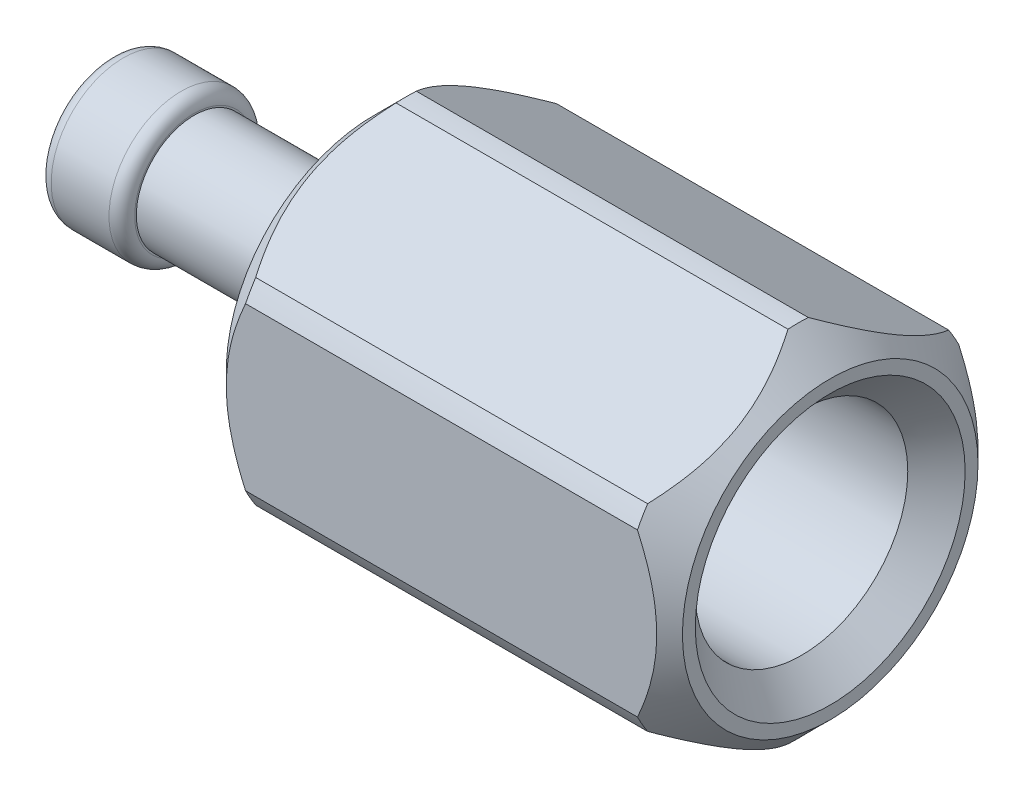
ISO-10303-21;
HEADER;
FILE_DESCRIPTION(('STEP AP214'),'2;1');
FILE_NAME('part.step','',(''),(''),'','','');
FILE_SCHEMA(('AUTOMOTIVE_DESIGN { 1 0 10303 214 1 1 1 1 }'));
ENDSEC;
DATA;
#1=APPLICATION_CONTEXT('core data for automotive mechanical design processes');
#2=APPLICATION_PROTOCOL_DEFINITION('international standard','automotive_design',2000,#1);
#3=PRODUCT_CONTEXT('',#1,'mechanical');
#4=PRODUCT('Part','Part','',(#3));
#5=PRODUCT_RELATED_PRODUCT_CATEGORY('part','',(#4));
#6=PRODUCT_DEFINITION_FORMATION('','',#4);
#7=PRODUCT_DEFINITION_CONTEXT('part definition',#1,'design');
#8=PRODUCT_DEFINITION('design','',#6,#7);
#9=PRODUCT_DEFINITION_SHAPE('','',#8);
#10=(LENGTH_UNIT() NAMED_UNIT(*) SI_UNIT(.MILLI.,.METRE.));
#11=(NAMED_UNIT(*) PLANE_ANGLE_UNIT() SI_UNIT($,.RADIAN.));
#12=(NAMED_UNIT(*) SI_UNIT($,.STERADIAN.) SOLID_ANGLE_UNIT());
#13=UNCERTAINTY_MEASURE_WITH_UNIT(LENGTH_MEASURE(1.E-05),#10,'distance_accuracy_value','');
#14=(GEOMETRIC_REPRESENTATION_CONTEXT(3) GLOBAL_UNCERTAINTY_ASSIGNED_CONTEXT((#13)) GLOBAL_UNIT_ASSIGNED_CONTEXT((#10,
#11,#12)) REPRESENTATION_CONTEXT('',''));
#15=CARTESIAN_POINT('',(0.,0.,0.));
#16=DIRECTION('',(0.,0.,1.));
#17=DIRECTION('',(1.,0.,0.));
#18=AXIS2_PLACEMENT_3D('',#15,#16,#17);
#19=CARTESIAN_POINT('',(-8.382,0.,0.));
#20=DIRECTION('',(1.,0.,0.));
#21=DIRECTION('',(0.,0.,-1.));
#22=AXIS2_PLACEMENT_3D('',#19,#20,#21);
#23=CONICAL_SURFACE('',#22,3.556,0.785398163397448);
#24=CARTESIAN_POINT('',(-9.017,0.,0.));
#25=DIRECTION('',(1.,0.,0.));
#26=DIRECTION('',(0.,0.,-1.));
#27=AXIS2_PLACEMENT_3D('',#24,#25,#26);
#28=CIRCLE('',#27,2.921);
#29=CARTESIAN_POINT('',(-9.017,0.,-2.921));
#30=VERTEX_POINT('',#29);
#31=EDGE_CURVE('E191',#30,#30,#28,.T.);
#32=ORIENTED_EDGE('',*,*,#31,.T.);
#33=EDGE_LOOP('',(#32));
#34=FACE_BOUND('',#33,.T.);
#35=CARTESIAN_POINT('',(-8.382,0.,0.));
#36=DIRECTION('',(1.,0.,0.));
#37=DIRECTION('',(0.,0.,-1.));
#38=AXIS2_PLACEMENT_3D('',#35,#36,#37);
#39=CIRCLE('',#38,3.556);
#40=CARTESIAN_POINT('',(-8.382,3.55033519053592,-0.200639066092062));
#41=VERTEX_POINT('',#40);
#42=CARTESIAN_POINT('',(-8.382,3.55033519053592,0.200639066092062));
#43=VERTEX_POINT('',#42);
#44=EDGE_CURVE('E163',#41,#43,#39,.T.);
#45=ORIENTED_EDGE('',*,*,#44,.F.);
#46=CARTESIAN_POINT('',(-8.3818,3.55055722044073,-0.200254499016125));
#47=CARTESIAN_POINT('',(-8.43296161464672,3.49375134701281,-0.298645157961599));
#48=CARTESIAN_POINT('',(-8.48060823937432,3.43606310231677,-0.398564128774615));
#49=CARTESIAN_POINT('',(-8.56688969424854,3.31877983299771,-0.601704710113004));
#50=CARTESIAN_POINT('',(-8.60548813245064,3.2591781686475,-0.704937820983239));
#51=CARTESIAN_POINT('',(-8.67084942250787,3.13911696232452,-0.91288993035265));
#52=CARTESIAN_POINT('',(-8.69775151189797,3.07867688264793,-1.01757521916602));
#53=CARTESIAN_POINT('',(-8.73833497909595,2.95677146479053,-1.22872159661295));
#54=CARTESIAN_POINT('',(-8.75203787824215,2.89530796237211,-1.33517950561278));
#55=CARTESIAN_POINT('',(-8.76460046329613,2.77647875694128,-1.54099772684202));
#56=CARTESIAN_POINT('',(-8.76446635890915,2.71913982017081,-1.64031167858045));
#57=CARTESIAN_POINT('',(-8.75185752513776,2.60477875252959,-1.83839085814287));
#58=CARTESIAN_POINT('',(-8.73937638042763,2.54775680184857,-1.93715577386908));
#59=CARTESIAN_POINT('',(-8.70303697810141,2.43465417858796,-2.13305526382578));
#60=CARTESIAN_POINT('',(-8.67917993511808,2.37857340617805,-2.23019001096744));
#61=CARTESIAN_POINT('',(-8.62164221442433,2.26768383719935,-2.42225637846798));
#62=CARTESIAN_POINT('',(-8.58795788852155,2.21287552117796,-2.51718716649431));
#63=CARTESIAN_POINT('',(-8.52532732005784,2.12309386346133,-2.67269355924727));
#64=CARTESIAN_POINT('',(-8.49866428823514,2.08771271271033,-2.73397550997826));
#65=CARTESIAN_POINT('',(-8.44236199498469,2.01769059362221,-2.85525737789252));
#66=CARTESIAN_POINT('',(-8.41273355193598,1.9830474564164,-2.91526105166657));
#67=CARTESIAN_POINT('',(-8.38180000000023,1.94870409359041,-2.97474550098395));
#68=B_SPLINE_CURVE_WITH_KNOTS('',3,(#46,#47,#48,#49,#50,#51,#52,#53,#54,#55,#56,#57,#58,#59,#60,
#61,#62,#63,#64,#65,#66,#67),.UNSPECIFIED.,.F.,.F.,(4,2,2,2,2,2,2,2,2,2,4),(0.,0.37399067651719,
0.749460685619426,1.12032967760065,1.4905929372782,1.83395154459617,2.17748864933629,
2.52098908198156,2.86461719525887,3.09140700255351,3.31739767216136),.UNSPECIFIED.);
#69=CARTESIAN_POINT('',(-8.382,1.94892612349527,-2.97436093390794));
#70=VERTEX_POINT('',#69);
#71=EDGE_CURVE('E382',#41,#70,#68,.T.);
#72=ORIENTED_EDGE('',*,*,#71,.T.);
#73=CARTESIAN_POINT('',(-8.382,1.60140906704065,-3.175));
#74=VERTEX_POINT('',#73);
#75=EDGE_CURVE('E187',#74,#70,#39,.T.);
#76=ORIENTED_EDGE('',*,*,#75,.F.);
#77=CARTESIAN_POINT('',(-7.07760151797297,-3.68006092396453,-3.175));
#78=CARTESIAN_POINT('',(-7.14534932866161,-3.59056345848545,-3.175));
#79=CARTESIAN_POINT('',(-7.21244941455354,-3.50056760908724,-3.175));
#80=CARTESIAN_POINT('',(-7.34506326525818,-3.31938150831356,-3.175));
#81=CARTESIAN_POINT('',(-7.41057663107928,-3.22819096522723,-3.175));
#82=CARTESIAN_POINT('',(-7.54019214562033,-3.04375072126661,-3.175));
#83=CARTESIAN_POINT('',(-7.60427943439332,-2.95049054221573,-3.175));
#84=CARTESIAN_POINT('',(-7.73008604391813,-2.76239141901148,-3.175));
#85=CARTESIAN_POINT('',(-7.79180553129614,-2.66755258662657,-3.175));
#86=CARTESIAN_POINT('',(-7.91584629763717,-2.47048506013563,-3.175));
#87=CARTESIAN_POINT('',(-7.97799459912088,-2.36814693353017,-3.175));
#88=CARTESIAN_POINT('',(-8.0982367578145,-2.16107936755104,-3.175));
#89=CARTESIAN_POINT('',(-8.15632996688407,-2.05634954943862,-3.175));
#90=CARTESIAN_POINT('',(-8.26721077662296,-1.84450279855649,-3.175));
#91=CARTESIAN_POINT('',(-8.32001397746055,-1.73739409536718,-3.175));
#92=CARTESIAN_POINT('',(-8.41913251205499,-1.52023971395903,-3.175));
#93=CARTESIAN_POINT('',(-8.4654508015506,-1.41019540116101,-3.175));
#94=CARTESIAN_POINT('',(-8.54643032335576,-1.19627791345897,-3.175));
#95=CARTESIAN_POINT('',(-8.58174080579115,-1.09265308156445,-3.175));
#96=CARTESIAN_POINT('',(-8.64405164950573,-0.882887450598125,-3.175));
#97=CARTESIAN_POINT('',(-8.6710514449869,-0.776746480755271,-3.175));
#98=CARTESIAN_POINT('',(-8.71487451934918,-0.564359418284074,-3.175));
#99=CARTESIAN_POINT('',(-8.7318736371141,-0.458150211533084,-3.175));
#100=CARTESIAN_POINT('',(-8.75536158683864,-0.244569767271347,-3.175));
#101=CARTESIAN_POINT('',(-8.76185227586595,-0.13719873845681,-3.175));
#102=CARTESIAN_POINT('',(-8.76383093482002,0.0736456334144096,-3.175));
#103=CARTESIAN_POINT('',(-8.75971932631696,0.177115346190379,-3.175));
#104=CARTESIAN_POINT('',(-8.74160961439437,0.383180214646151,-3.175));
#105=CARTESIAN_POINT('',(-8.72761055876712,0.485775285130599,-3.175));
#106=CARTESIAN_POINT('',(-8.69025559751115,0.691083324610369,-3.175));
#107=CARTESIAN_POINT('',(-8.66673961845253,0.793766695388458,-3.175));
#108=CARTESIAN_POINT('',(-8.61161215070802,0.996893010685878,-3.175));
#109=CARTESIAN_POINT('',(-8.58000130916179,1.09733613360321,-3.175));
#110=CARTESIAN_POINT('',(-8.50693122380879,1.30453917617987,-3.175));
#111=CARTESIAN_POINT('',(-8.46485028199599,1.41107758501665,-3.175));
#112=CARTESIAN_POINT('',(-8.37422677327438,1.62137761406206,-3.175));
#113=CARTESIAN_POINT('',(-8.32568205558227,1.72513829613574,-3.175));
#114=CARTESIAN_POINT('',(-8.22327748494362,1.9304084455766,-3.175));
#115=CARTESIAN_POINT('',(-8.16940066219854,2.03190937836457,-3.175));
#116=CARTESIAN_POINT('',(-8.05752456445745,2.23257709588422,-3.175));
#117=CARTESIAN_POINT('',(-7.99952594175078,2.33174424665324,-3.175));
#118=CARTESIAN_POINT('',(-7.88318080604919,2.52317617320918,-3.175));
#119=CARTESIAN_POINT('',(-7.8249948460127,2.6155390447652,-3.175));
#120=CARTESIAN_POINT('',(-7.70617105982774,2.79867890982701,-3.175));
#121=CARTESIAN_POINT('',(-7.64553304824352,2.88945578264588,-3.175));
#122=CARTESIAN_POINT('',(-7.52274299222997,3.06889606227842,-3.175));
#123=CARTESIAN_POINT('',(-7.46060721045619,3.15757063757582,-3.175));
#124=CARTESIAN_POINT('',(-7.33468867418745,3.33370714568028,-3.175));
#125=CARTESIAN_POINT('',(-7.27090637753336,3.42116940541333,-3.175));
#126=CARTESIAN_POINT('',(-7.2064507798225,3.50812386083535,-3.175));
#127=B_SPLINE_CURVE_WITH_KNOTS('',3,(#77,#78,#79,#80,#81,#82,#83,#84,#85,#86,#87,#88,#89,#90,
#91,#92,#93,#94,#95,#96,#97,#98,#99,#100,#101,#102,#103,#104,#105,#106,#107,#108,#109,#110,#111,
#112,#113,#114,#115,#116,#117,#118,#119,#120,#121,#122,#123,#124,#125,#126),.UNSPECIFIED.,.F.,
.F.,(4,2,2,2,2,2,2,2,2,2,2,2,2,2,2,2,2,2,2,2,2,2,2,2,4),(0.,0.336749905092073,0.673583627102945,
1.01302616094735,1.35244476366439,1.71156294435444,2.07073839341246,2.42882136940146,
2.78674060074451,3.11488011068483,3.44304195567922,3.7652466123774,4.08739432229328,
4.39755499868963,4.70774554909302,5.02338597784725,5.33900118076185,5.68237822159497,
6.02586980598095,6.37049205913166,6.71505989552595,7.0425026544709,7.36997022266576,
7.69478261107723,8.01950563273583),.UNSPECIFIED.);
#128=CARTESIAN_POINT('',(-8.382,-1.60140906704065,-3.175));
#129=VERTEX_POINT('',#128);
#130=EDGE_CURVE('E291',#74,#129,#127,.F.);
#131=ORIENTED_EDGE('',*,*,#130,.T.);
#132=CARTESIAN_POINT('',(-8.382,-1.94892612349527,-2.97436093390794));
#133=VERTEX_POINT('',#132);
#134=EDGE_CURVE('E179',#133,#129,#39,.T.);
#135=ORIENTED_EDGE('',*,*,#134,.F.);
#136=CARTESIAN_POINT('',(-8.3818,-1.94870409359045,-2.97474550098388));
#137=CARTESIAN_POINT('',(-8.43296161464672,-2.00550996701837,-2.8763548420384));
#138=CARTESIAN_POINT('',(-8.48060823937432,-2.06319821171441,-2.77643587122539));
#139=CARTESIAN_POINT('',(-8.56688969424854,-2.18048148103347,-2.573295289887));
#140=CARTESIAN_POINT('',(-8.60548813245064,-2.24008314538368,-2.47006217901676));
#141=CARTESIAN_POINT('',(-8.67084942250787,-2.36014435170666,-2.26211006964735));
#142=CARTESIAN_POINT('',(-8.69775151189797,-2.42058443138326,-2.15742478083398));
#143=CARTESIAN_POINT('',(-8.73833497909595,-2.54248984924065,-1.94627840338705));
#144=CARTESIAN_POINT('',(-8.75203787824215,-2.60395335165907,-1.83982049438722));
#145=CARTESIAN_POINT('',(-8.76460046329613,-2.7227825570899,-1.63400227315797));
#146=CARTESIAN_POINT('',(-8.76446635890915,-2.78012149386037,-1.53468832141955));
#147=CARTESIAN_POINT('',(-8.75185752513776,-2.89448256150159,-1.33660914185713));
#148=CARTESIAN_POINT('',(-8.73937638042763,-2.95150451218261,-1.23784422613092));
#149=CARTESIAN_POINT('',(-8.70303697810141,-3.06460713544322,-1.04194473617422));
#150=CARTESIAN_POINT('',(-8.67917993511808,-3.12068790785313,-0.944809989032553));
#151=CARTESIAN_POINT('',(-8.62164221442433,-3.23157747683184,-0.752743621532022));
#152=CARTESIAN_POINT('',(-8.58795788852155,-3.28638579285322,-0.657812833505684));
#153=CARTESIAN_POINT('',(-8.52532732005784,-3.37616745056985,-0.502306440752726));
#154=CARTESIAN_POINT('',(-8.49866428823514,-3.41154860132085,-0.441024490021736));
#155=CARTESIAN_POINT('',(-8.44236199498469,-3.48157072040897,-0.319742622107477));
#156=CARTESIAN_POINT('',(-8.41273355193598,-3.51621385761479,-0.259738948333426));
#157=CARTESIAN_POINT('',(-8.38180000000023,-3.55055722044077,-0.200254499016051));
#158=B_SPLINE_CURVE_WITH_KNOTS('',3,(#136,#137,#138,#139,#140,#141,#142,#143,#144,#145,#146,
#147,#148,#149,#150,#151,#152,#153,#154,#155,#156,#157),.UNSPECIFIED.,.F.,.F.,(4,2,2,2,2,2,2,2,
2,2,4),(0.,0.373990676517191,0.749460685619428,1.12032967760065,1.4905929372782,
1.83395154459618,2.17748864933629,2.52098908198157,2.86461719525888,3.09140700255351,
3.31739767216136),.UNSPECIFIED.);
#159=CARTESIAN_POINT('',(-8.382,-3.55033519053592,-0.200639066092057));
#160=VERTEX_POINT('',#159);
#161=EDGE_CURVE('E282',#133,#160,#158,.T.);
#162=ORIENTED_EDGE('',*,*,#161,.T.);
#163=CARTESIAN_POINT('',(-8.382,-3.55033519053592,0.200639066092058));
#164=VERTEX_POINT('',#163);
#165=EDGE_CURVE('E466',#164,#160,#39,.T.);
#166=ORIENTED_EDGE('',*,*,#165,.F.);
#167=CARTESIAN_POINT('',(-8.3818,-3.55055722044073,0.200254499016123));
#168=CARTESIAN_POINT('',(-8.43296161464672,-3.49375134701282,0.298645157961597));
#169=CARTESIAN_POINT('',(-8.48060823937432,-3.43606310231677,0.398564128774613));
#170=CARTESIAN_POINT('',(-8.56688969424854,-3.31877983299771,0.601704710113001));
#171=CARTESIAN_POINT('',(-8.60548813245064,-3.2591781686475,0.704937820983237));
#172=CARTESIAN_POINT('',(-8.67084942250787,-3.13911696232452,0.912889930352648));
#173=CARTESIAN_POINT('',(-8.69775151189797,-3.07867688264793,1.01757521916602));
#174=CARTESIAN_POINT('',(-8.73833497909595,-2.95677146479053,1.22872159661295));
#175=CARTESIAN_POINT('',(-8.75203787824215,-2.89530796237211,1.33517950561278));
#176=CARTESIAN_POINT('',(-8.76460046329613,-2.77647875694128,1.54099772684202));
#177=CARTESIAN_POINT('',(-8.76446635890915,-2.71913982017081,1.64031167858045));
#178=CARTESIAN_POINT('',(-8.75185752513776,-2.60477875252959,1.83839085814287));
#179=CARTESIAN_POINT('',(-8.73937638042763,-2.54775680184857,1.93715577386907));
#180=CARTESIAN_POINT('',(-8.70303697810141,-2.43465417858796,2.13305526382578));
#181=CARTESIAN_POINT('',(-8.67917993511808,-2.37857340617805,2.23019001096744));
#182=CARTESIAN_POINT('',(-8.62164221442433,-2.26768383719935,2.42225637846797));
#183=CARTESIAN_POINT('',(-8.58795788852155,-2.21287552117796,2.51718716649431));
#184=CARTESIAN_POINT('',(-8.52532732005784,-2.12309386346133,2.67269355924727));
#185=CARTESIAN_POINT('',(-8.49866428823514,-2.08771271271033,2.73397550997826));
#186=CARTESIAN_POINT('',(-8.44236199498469,-2.01769059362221,2.85525737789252));
#187=CARTESIAN_POINT('',(-8.41273355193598,-1.98304745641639,2.91526105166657));
#188=CARTESIAN_POINT('',(-8.38180000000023,-1.94870409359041,2.97474550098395));
#189=B_SPLINE_CURVE_WITH_KNOTS('',3,(#167,#168,#169,#170,#171,#172,#173,#174,#175,#176,#177,
#178,#179,#180,#181,#182,#183,#184,#185,#186,#187,#188),.UNSPECIFIED.,.F.,.F.,(4,2,2,2,2,2,2,2,
2,2,4),(0.,0.37399067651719,0.749460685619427,1.12032967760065,1.4905929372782,1.83395154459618,
2.17748864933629,2.52098908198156,2.86461719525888,3.09140700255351,3.31739767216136),.UNSPECIFIED.);
#190=CARTESIAN_POINT('',(-8.382,-1.94892612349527,2.97436093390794));
#191=VERTEX_POINT('',#190);
#192=EDGE_CURVE('E274',#164,#191,#189,.T.);
#193=ORIENTED_EDGE('',*,*,#192,.T.);
#194=CARTESIAN_POINT('',(-8.382,-1.60140906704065,3.175));
#195=VERTEX_POINT('',#194);
#196=EDGE_CURVE('E459',#195,#191,#39,.T.);
#197=ORIENTED_EDGE('',*,*,#196,.F.);
#198=CARTESIAN_POINT('',(-7.07760151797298,-3.68006092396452,3.175));
#199=CARTESIAN_POINT('',(-7.14534932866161,-3.59056345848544,3.175));
#200=CARTESIAN_POINT('',(-7.21244941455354,-3.50056760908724,3.175));
#201=CARTESIAN_POINT('',(-7.34506326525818,-3.31938150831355,3.175));
#202=CARTESIAN_POINT('',(-7.41057663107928,-3.22819096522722,3.175));
#203=CARTESIAN_POINT('',(-7.54019214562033,-3.04375072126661,3.175));
#204=CARTESIAN_POINT('',(-7.60427943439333,-2.95049054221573,3.175));
#205=CARTESIAN_POINT('',(-7.73008604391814,-2.76239141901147,3.175));
#206=CARTESIAN_POINT('',(-7.79180553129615,-2.66755258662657,3.175));
#207=CARTESIAN_POINT('',(-7.91584629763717,-2.47048506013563,3.175));
#208=CARTESIAN_POINT('',(-7.97799459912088,-2.36814693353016,3.175));
#209=CARTESIAN_POINT('',(-8.0982367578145,-2.16107936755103,3.175));
#210=CARTESIAN_POINT('',(-8.15632996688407,-2.05634954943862,3.175));
#211=CARTESIAN_POINT('',(-8.26721077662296,-1.84450279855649,3.175));
#212=CARTESIAN_POINT('',(-8.32001397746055,-1.73739409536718,3.175));
#213=CARTESIAN_POINT('',(-8.41913251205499,-1.52023971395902,3.175));
#214=CARTESIAN_POINT('',(-8.4654508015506,-1.41019540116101,3.175));
#215=CARTESIAN_POINT('',(-8.54643032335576,-1.19627791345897,3.175));
#216=CARTESIAN_POINT('',(-8.58174080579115,-1.09265308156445,3.175));
#217=CARTESIAN_POINT('',(-8.64405164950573,-0.882887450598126,3.175));
#218=CARTESIAN_POINT('',(-8.6710514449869,-0.776746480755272,3.175));
#219=CARTESIAN_POINT('',(-8.71487451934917,-0.564359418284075,3.175));
#220=CARTESIAN_POINT('',(-8.7318736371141,-0.458150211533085,3.175));
#221=CARTESIAN_POINT('',(-8.75536158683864,-0.244569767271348,3.175));
#222=CARTESIAN_POINT('',(-8.76185227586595,-0.137198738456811,3.175));
#223=CARTESIAN_POINT('',(-8.76383093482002,0.0736456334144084,3.175));
#224=CARTESIAN_POINT('',(-8.75971932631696,0.177115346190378,3.175));
#225=CARTESIAN_POINT('',(-8.74160961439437,0.38318021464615,3.175));
#226=CARTESIAN_POINT('',(-8.72761055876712,0.485775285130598,3.175));
#227=CARTESIAN_POINT('',(-8.69025559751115,0.691083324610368,3.175));
#228=CARTESIAN_POINT('',(-8.66673961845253,0.793766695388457,3.175));
#229=CARTESIAN_POINT('',(-8.61161215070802,0.996893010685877,3.175));
#230=CARTESIAN_POINT('',(-8.58000130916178,1.0973361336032,3.175));
#231=CARTESIAN_POINT('',(-8.50693122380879,1.30453917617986,3.175));
#232=CARTESIAN_POINT('',(-8.46485028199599,1.41107758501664,3.175));
#233=CARTESIAN_POINT('',(-8.37422677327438,1.62137761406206,3.175));
#234=CARTESIAN_POINT('',(-8.32568205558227,1.72513829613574,3.175));
#235=CARTESIAN_POINT('',(-8.22327748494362,1.9304084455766,3.175));
#236=CARTESIAN_POINT('',(-8.16940066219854,2.03190937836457,3.175));
#237=CARTESIAN_POINT('',(-8.05752456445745,2.23257709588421,3.175));
#238=CARTESIAN_POINT('',(-7.99952594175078,2.33174424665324,3.175));
#239=CARTESIAN_POINT('',(-7.88318080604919,2.52317617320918,3.175));
#240=CARTESIAN_POINT('',(-7.8249948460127,2.6155390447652,3.175));
#241=CARTESIAN_POINT('',(-7.70617105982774,2.79867890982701,3.175));
#242=CARTESIAN_POINT('',(-7.64553304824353,2.88945578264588,3.175));
#243=CARTESIAN_POINT('',(-7.52274299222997,3.06889606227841,3.175));
#244=CARTESIAN_POINT('',(-7.46060721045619,3.15757063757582,3.175));
#245=CARTESIAN_POINT('',(-7.33468867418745,3.33370714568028,3.175));
#246=CARTESIAN_POINT('',(-7.27090637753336,3.42116940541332,3.175));
#247=CARTESIAN_POINT('',(-7.2064507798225,3.50812386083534,3.175));
#248=B_SPLINE_CURVE_WITH_KNOTS('',3,(#198,#199,#200,#201,#202,#203,#204,#205,#206,#207,#208,
#209,#210,#211,#212,#213,#214,#215,#216,#217,#218,#219,#220,#221,#222,#223,#224,#225,#226,#227,
#228,#229,#230,#231,#232,#233,#234,#235,#236,#237,#238,#239,#240,#241,#242,#243,#244,#245,#246,
#247),.UNSPECIFIED.,.F.,.F.,(4,2,2,2,2,2,2,2,2,2,2,2,2,2,2,2,2,2,2,2,2,2,2,2,4),(0.,
0.336749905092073,0.673583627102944,1.01302616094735,1.35244476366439,1.71156294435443,
2.07073839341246,2.42882136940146,2.78674060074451,3.11488011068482,3.44304195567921,
3.7652466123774,4.08739432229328,4.39755499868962,4.70774554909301,5.02338597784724,
5.33900118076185,5.68237822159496,6.02586980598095,6.37049205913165,6.71505989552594,
7.04250265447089,7.36997022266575,7.69478261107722,8.01950563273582),.UNSPECIFIED.);
#249=CARTESIAN_POINT('',(-8.382,1.60140906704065,3.175));
#250=VERTEX_POINT('',#249);
#251=EDGE_CURVE('E266',#195,#250,#248,.T.);
#252=ORIENTED_EDGE('',*,*,#251,.T.);
#253=CARTESIAN_POINT('',(-8.382,1.94892612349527,2.97436093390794));
#254=VERTEX_POINT('',#253);
#255=EDGE_CURVE('E458',#254,#250,#39,.T.);
#256=ORIENTED_EDGE('',*,*,#255,.F.);
#257=CARTESIAN_POINT('',(-8.3818,1.94870409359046,2.97474550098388));
#258=CARTESIAN_POINT('',(-8.43296161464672,2.00550996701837,2.8763548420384));
#259=CARTESIAN_POINT('',(-8.48060823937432,2.06319821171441,2.77643587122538));
#260=CARTESIAN_POINT('',(-8.56688969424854,2.18048148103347,2.573295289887));
#261=CARTESIAN_POINT('',(-8.60548813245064,2.24008314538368,2.47006217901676));
#262=CARTESIAN_POINT('',(-8.67084942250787,2.36014435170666,2.26211006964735));
#263=CARTESIAN_POINT('',(-8.69775151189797,2.42058443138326,2.15742478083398));
#264=CARTESIAN_POINT('',(-8.73833497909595,2.54248984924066,1.94627840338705));
#265=CARTESIAN_POINT('',(-8.75203787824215,2.60395335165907,1.83982049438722));
#266=CARTESIAN_POINT('',(-8.76460046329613,2.72278255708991,1.63400227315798));
#267=CARTESIAN_POINT('',(-8.76446635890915,2.78012149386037,1.53468832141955));
#268=CARTESIAN_POINT('',(-8.75185752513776,2.89448256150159,1.33660914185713));
#269=CARTESIAN_POINT('',(-8.73937638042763,2.95150451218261,1.23784422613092));
#270=CARTESIAN_POINT('',(-8.70303697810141,3.06460713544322,1.04194473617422));
#271=CARTESIAN_POINT('',(-8.67917993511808,3.12068790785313,0.944809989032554));
#272=CARTESIAN_POINT('',(-8.62164221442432,3.23157747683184,0.752743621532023));
#273=CARTESIAN_POINT('',(-8.58795788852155,3.28638579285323,0.657812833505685));
#274=CARTESIAN_POINT('',(-8.52532732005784,3.37616745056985,0.502306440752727));
#275=CARTESIAN_POINT('',(-8.49866428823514,3.41154860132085,0.441024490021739));
#276=CARTESIAN_POINT('',(-8.44236199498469,3.48157072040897,0.31974262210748));
#277=CARTESIAN_POINT('',(-8.41273355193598,3.51621385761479,0.259738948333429));
#278=CARTESIAN_POINT('',(-8.38180000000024,3.55055722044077,0.200254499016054));
#279=B_SPLINE_CURVE_WITH_KNOTS('',3,(#257,#258,#259,#260,#261,#262,#263,#264,#265,#266,#267,
#268,#269,#270,#271,#272,#273,#274,#275,#276,#277,#278),.UNSPECIFIED.,.F.,.F.,(4,2,2,2,2,2,2,2,
2,2,4),(0.,0.37399067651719,0.749460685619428,1.12032967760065,1.4905929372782,1.83395154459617,
2.17748864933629,2.52098908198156,2.86461719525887,3.09140700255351,3.31739767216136),.UNSPECIFIED.);
#280=EDGE_CURVE('E245',#254,#43,#279,.T.);
#281=ORIENTED_EDGE('',*,*,#280,.T.);
#282=EDGE_LOOP('',(#45,#72,#76,#131,#135,#162,#166,#193,#197,#252,#256,#281));
#283=FACE_BOUND('',#282,.T.);
#284=ADVANCED_FACE('F16',(#34,#283),#23,.T.);
#285=CARTESIAN_POINT('',(0.,0.,0.));
#286=DIRECTION('',(1.,0.,0.));
#287=DIRECTION('',(0.,0.,-1.));
#288=AXIS2_PLACEMENT_3D('',#285,#286,#287);
#289=CYLINDRICAL_SURFACE('',#288,3.556);
#290=CARTESIAN_POINT('',(-0.635,0.,0.));
#291=DIRECTION('',(1.,0.,0.));
#292=DIRECTION('',(0.,0.,-1.));
#293=AXIS2_PLACEMENT_3D('',#290,#291,#292);
#294=CIRCLE('',#293,3.556);
#295=CARTESIAN_POINT('',(-0.635,3.55033519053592,-0.20063906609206));
#296=VERTEX_POINT('',#295);
#297=CARTESIAN_POINT('',(-0.635,3.55033519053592,0.20063906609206));
#298=VERTEX_POINT('',#297);
#299=EDGE_CURVE('E161',#296,#298,#294,.T.);
#300=ORIENTED_EDGE('',*,*,#299,.F.);
#301=DIRECTION('',(1.,0.,0.));
#302=VECTOR('',#301,1.);
#303=CARTESIAN_POINT('',(0.,3.55033519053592,-0.200639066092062));
#304=LINE('',#303,#302);
#305=EDGE_CURVE('E390',#296,#41,#304,.F.);
#306=ORIENTED_EDGE('',*,*,#305,.T.);
#307=ORIENTED_EDGE('',*,*,#44,.T.);
#308=DIRECTION('',(1.,0.,0.));
#309=VECTOR('',#308,1.);
#310=CARTESIAN_POINT('',(0.,3.55033519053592,0.200639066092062));
#311=LINE('',#310,#309);
#312=EDGE_CURVE('E144',#43,#298,#311,.T.);
#313=ORIENTED_EDGE('',*,*,#312,.T.);
#314=EDGE_LOOP('',(#300,#306,#307,#313));
#315=FACE_BOUND('',#314,.T.);
#316=ADVANCED_FACE('F159',(#315),#289,.T.);
#317=ORIENTED_EDGE('',*,*,#75,.T.);
#318=DIRECTION('',(1.,0.,0.));
#319=VECTOR('',#318,1.);
#320=CARTESIAN_POINT('',(0.,1.94892612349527,-2.97436093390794));
#321=LINE('',#320,#319);
#322=CARTESIAN_POINT('',(-0.634999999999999,1.94892612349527,-2.97436093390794));
#323=VERTEX_POINT('',#322);
#324=EDGE_CURVE('E301',#70,#323,#321,.T.);
#325=ORIENTED_EDGE('',*,*,#324,.T.);
#326=CARTESIAN_POINT('',(-0.635,1.60140906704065,-3.175));
#327=VERTEX_POINT('',#326);
#328=EDGE_CURVE('E170',#327,#323,#294,.T.);
#329=ORIENTED_EDGE('',*,*,#328,.F.);
#330=DIRECTION('',(1.,0.,0.));
#331=VECTOR('',#330,1.);
#332=CARTESIAN_POINT('',(0.,1.60140906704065,-3.175));
#333=LINE('',#332,#331);
#334=EDGE_CURVE('E302',#327,#74,#333,.F.);
#335=ORIENTED_EDGE('',*,*,#334,.T.);
#336=EDGE_LOOP('',(#317,#325,#329,#335));
#337=FACE_BOUND('',#336,.T.);
#338=ADVANCED_FACE('F412',(#337),#289,.T.);
#339=ORIENTED_EDGE('',*,*,#134,.T.);
#340=DIRECTION('',(1.,0.,0.));
#341=VECTOR('',#340,1.);
#342=CARTESIAN_POINT('',(0.,-1.60140906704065,-3.175));
#343=LINE('',#342,#341);
#344=CARTESIAN_POINT('',(-0.635,-1.60140906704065,-3.175));
#345=VERTEX_POINT('',#344);
#346=EDGE_CURVE('E416',#129,#345,#343,.T.);
#347=ORIENTED_EDGE('',*,*,#346,.T.);
#348=CARTESIAN_POINT('',(-0.635,-1.94892612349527,-2.97436093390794));
#349=VERTEX_POINT('',#348);
#350=EDGE_CURVE('E180',#349,#345,#294,.T.);
#351=ORIENTED_EDGE('',*,*,#350,.F.);
#352=DIRECTION('',(1.,0.,0.));
#353=VECTOR('',#352,1.);
#354=CARTESIAN_POINT('',(0.,-1.94892612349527,-2.97436093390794));
#355=LINE('',#354,#353);
#356=EDGE_CURVE('E43',#349,#133,#355,.F.);
#357=ORIENTED_EDGE('',*,*,#356,.T.);
#358=EDGE_LOOP('',(#339,#347,#351,#357));
#359=FACE_BOUND('',#358,.T.);
#360=ADVANCED_FACE('F419',(#359),#289,.T.);
#361=ORIENTED_EDGE('',*,*,#165,.T.);
#362=DIRECTION('',(1.,0.,0.));
#363=VECTOR('',#362,1.);
#364=CARTESIAN_POINT('',(0.,-3.55033519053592,-0.200639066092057));
#365=LINE('',#364,#363);
#366=CARTESIAN_POINT('',(-0.635,-3.55033519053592,-0.200639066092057));
#367=VERTEX_POINT('',#366);
#368=EDGE_CURVE('E434',#160,#367,#365,.T.);
#369=ORIENTED_EDGE('',*,*,#368,.T.);
#370=CARTESIAN_POINT('',(-0.635,-3.55033519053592,0.200639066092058));
#371=VERTEX_POINT('',#370);
#372=EDGE_CURVE('E362',#371,#367,#294,.T.);
#373=ORIENTED_EDGE('',*,*,#372,.F.);
#374=DIRECTION('',(1.,0.,0.));
#375=VECTOR('',#374,1.);
#376=CARTESIAN_POINT('',(0.,-3.55033519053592,0.200639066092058));
#377=LINE('',#376,#375);
#378=EDGE_CURVE('E53',#371,#164,#377,.F.);
#379=ORIENTED_EDGE('',*,*,#378,.T.);
#380=EDGE_LOOP('',(#361,#369,#373,#379));
#381=FACE_BOUND('',#380,.T.);
#382=ADVANCED_FACE('F619',(#381),#289,.T.);
#383=ORIENTED_EDGE('',*,*,#196,.T.);
#384=DIRECTION('',(1.,0.,0.));
#385=VECTOR('',#384,1.);
#386=CARTESIAN_POINT('',(0.,-1.94892612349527,2.97436093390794));
#387=LINE('',#386,#385);
#388=CARTESIAN_POINT('',(-0.635,-1.94892612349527,2.97436093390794));
#389=VERTEX_POINT('',#388);
#390=EDGE_CURVE('E360',#191,#389,#387,.T.);
#391=ORIENTED_EDGE('',*,*,#390,.T.);
#392=CARTESIAN_POINT('',(-0.635,-1.60140906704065,3.175));
#393=VERTEX_POINT('',#392);
#394=EDGE_CURVE('E182',#393,#389,#294,.T.);
#395=ORIENTED_EDGE('',*,*,#394,.F.);
#396=DIRECTION('',(1.,0.,0.));
#397=VECTOR('',#396,1.);
#398=CARTESIAN_POINT('',(0.,-1.60140906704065,3.175));
#399=LINE('',#398,#397);
#400=EDGE_CURVE('E348',#393,#195,#399,.F.);
#401=ORIENTED_EDGE('',*,*,#400,.T.);
#402=EDGE_LOOP('',(#383,#391,#395,#401));
#403=FACE_BOUND('',#402,.T.);
#404=ADVANCED_FACE('F359',(#403),#289,.T.);
#405=ORIENTED_EDGE('',*,*,#255,.T.);
#406=DIRECTION('',(1.,0.,0.));
#407=VECTOR('',#406,1.);
#408=CARTESIAN_POINT('',(0.,1.60140906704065,3.175));
#409=LINE('',#408,#407);
#410=CARTESIAN_POINT('',(-0.635,1.60140906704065,3.175));
#411=VERTEX_POINT('',#410);
#412=EDGE_CURVE('E254',#250,#411,#409,.T.);
#413=ORIENTED_EDGE('',*,*,#412,.T.);
#414=CARTESIAN_POINT('',(-0.635,1.94892612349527,2.97436093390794));
#415=VERTEX_POINT('',#414);
#416=EDGE_CURVE('E171',#415,#411,#294,.T.);
#417=ORIENTED_EDGE('',*,*,#416,.F.);
#418=DIRECTION('',(1.,0.,0.));
#419=VECTOR('',#418,1.);
#420=CARTESIAN_POINT('',(0.,1.94892612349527,2.97436093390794));
#421=LINE('',#420,#419);
#422=EDGE_CURVE('E147',#415,#254,#421,.F.);
#423=ORIENTED_EDGE('',*,*,#422,.T.);
#424=EDGE_LOOP('',(#405,#413,#417,#423));
#425=FACE_BOUND('',#424,.T.);
#426=ADVANCED_FACE('F461',(#425),#289,.T.);
#427=CARTESIAN_POINT('',(0.,0.,0.));
#428=DIRECTION('',(-1.,0.,0.));
#429=DIRECTION('',(0.,0.,1.));
#430=AXIS2_PLACEMENT_3D('',#427,#428,#429);
#431=CONICAL_SURFACE('',#430,2.921,0.785398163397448);
#432=CARTESIAN_POINT('',(0.,0.,0.));
#433=DIRECTION('',(1.,0.,0.));
#434=DIRECTION('',(0.,0.,-1.));
#435=AXIS2_PLACEMENT_3D('',#432,#433,#434);
#436=CIRCLE('',#435,2.921);
#437=CARTESIAN_POINT('',(0.,0.,-2.921));
#438=VERTEX_POINT('',#437);
#439=EDGE_CURVE('E185',#438,#438,#436,.T.);
#440=ORIENTED_EDGE('',*,*,#439,.F.);
#441=EDGE_LOOP('',(#440));
#442=FACE_BOUND('',#441,.T.);
#443=ORIENTED_EDGE('',*,*,#328,.T.);
#444=CARTESIAN_POINT('',(-0.635200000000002,1.94870409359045,-2.97474550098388));
#445=CARTESIAN_POINT('',(-0.58403838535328,2.00550996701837,-2.8763548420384));
#446=CARTESIAN_POINT('',(-0.53639176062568,2.06319821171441,-2.77643587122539));
#447=CARTESIAN_POINT('',(-0.450110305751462,2.18048148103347,-2.573295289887));
#448=CARTESIAN_POINT('',(-0.411511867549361,2.24008314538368,-2.47006217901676));
#449=CARTESIAN_POINT('',(-0.346150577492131,2.36014435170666,-2.26211006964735));
#450=CARTESIAN_POINT('',(-0.31924848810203,2.42058443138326,-2.15742478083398));
#451=CARTESIAN_POINT('',(-0.278665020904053,2.54248984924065,-1.94627840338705));
#452=CARTESIAN_POINT('',(-0.264962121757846,2.60395335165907,-1.83982049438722));
#453=CARTESIAN_POINT('',(-0.252399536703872,2.72278255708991,-1.63400227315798));
#454=CARTESIAN_POINT('',(-0.252533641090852,2.78012149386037,-1.53468832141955));
#455=CARTESIAN_POINT('',(-0.26514247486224,2.89448256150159,-1.33660914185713));
#456=CARTESIAN_POINT('',(-0.277623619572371,2.95150451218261,-1.23784422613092));
#457=CARTESIAN_POINT('',(-0.313963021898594,3.06460713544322,-1.04194473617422));
#458=CARTESIAN_POINT('',(-0.33782006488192,3.12068790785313,-0.944809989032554));
#459=CARTESIAN_POINT('',(-0.395357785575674,3.23157747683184,-0.752743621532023));
#460=CARTESIAN_POINT('',(-0.429042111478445,3.28638579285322,-0.657812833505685));
#461=CARTESIAN_POINT('',(-0.491672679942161,3.37616745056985,-0.502306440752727));
#462=CARTESIAN_POINT('',(-0.518335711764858,3.41154860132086,-0.441024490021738));
#463=CARTESIAN_POINT('',(-0.574638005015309,3.48157072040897,-0.319742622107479));
#464=CARTESIAN_POINT('',(-0.604266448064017,3.51621385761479,-0.259738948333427));
#465=CARTESIAN_POINT('',(-0.635199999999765,3.55055722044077,-0.200254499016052));
#466=B_SPLINE_CURVE_WITH_KNOTS('',3,(#444,#445,#446,#447,#448,#449,#450,#451,#452,#453,#454,
#455,#456,#457,#458,#459,#460,#461,#462,#463,#464,#465),.UNSPECIFIED.,.F.,.F.,(4,2,2,2,2,2,2,2,
2,2,4),(0.,0.37399067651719,0.749460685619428,1.12032967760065,1.4905929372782,1.83395154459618,
2.17748864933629,2.52098908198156,2.86461719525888,3.09140700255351,3.31739767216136),.UNSPECIFIED.);
#467=EDGE_CURVE('E10',#323,#296,#466,.T.);
#468=ORIENTED_EDGE('',*,*,#467,.T.);
#469=ORIENTED_EDGE('',*,*,#299,.T.);
#470=CARTESIAN_POINT('',(-0.6352,3.55055722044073,0.200254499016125));
#471=CARTESIAN_POINT('',(-0.584038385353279,3.49375134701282,0.298645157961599));
#472=CARTESIAN_POINT('',(-0.536391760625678,3.43606310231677,0.398564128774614));
#473=CARTESIAN_POINT('',(-0.450110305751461,3.31877983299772,0.601704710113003));
#474=CARTESIAN_POINT('',(-0.41151186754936,3.2591781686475,0.704937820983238));
#475=CARTESIAN_POINT('',(-0.346150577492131,3.13911696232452,0.912889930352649));
#476=CARTESIAN_POINT('',(-0.31924848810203,3.07867688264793,1.01757521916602));
#477=CARTESIAN_POINT('',(-0.278665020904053,2.95677146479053,1.22872159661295));
#478=CARTESIAN_POINT('',(-0.264962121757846,2.89530796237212,1.33517950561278));
#479=CARTESIAN_POINT('',(-0.252399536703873,2.77647875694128,1.54099772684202));
#480=CARTESIAN_POINT('',(-0.252533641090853,2.71913982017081,1.64031167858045));
#481=CARTESIAN_POINT('',(-0.26514247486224,2.60477875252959,1.83839085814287));
#482=CARTESIAN_POINT('',(-0.277623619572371,2.54775680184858,1.93715577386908));
#483=CARTESIAN_POINT('',(-0.313963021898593,2.43465417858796,2.13305526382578));
#484=CARTESIAN_POINT('',(-0.337820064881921,2.37857340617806,2.23019001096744));
#485=CARTESIAN_POINT('',(-0.395357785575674,2.26768383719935,2.42225637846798));
#486=CARTESIAN_POINT('',(-0.429042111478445,2.21287552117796,2.51718716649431));
#487=CARTESIAN_POINT('',(-0.491672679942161,2.12309386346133,2.67269355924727));
#488=CARTESIAN_POINT('',(-0.518335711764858,2.08771271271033,2.73397550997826));
#489=CARTESIAN_POINT('',(-0.57463800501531,2.01769059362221,2.85525737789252));
#490=CARTESIAN_POINT('',(-0.604266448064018,1.9830474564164,2.91526105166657));
#491=CARTESIAN_POINT('',(-0.635199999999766,1.94870409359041,2.97474550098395));
#492=B_SPLINE_CURVE_WITH_KNOTS('',3,(#470,#471,#472,#473,#474,#475,#476,#477,#478,#479,#480,
#481,#482,#483,#484,#485,#486,#487,#488,#489,#490,#491),.UNSPECIFIED.,.F.,.F.,(4,2,2,2,2,2,2,2,
2,2,4),(0.,0.373990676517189,0.749460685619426,1.12032967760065,1.4905929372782,
1.83395154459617,2.17748864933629,2.52098908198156,2.86461719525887,3.09140700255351,
3.31739767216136),.UNSPECIFIED.);
#493=EDGE_CURVE('E141',#298,#415,#492,.T.);
#494=ORIENTED_EDGE('',*,*,#493,.T.);
#495=ORIENTED_EDGE('',*,*,#416,.T.);
#496=CARTESIAN_POINT('',(-1.93939848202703,-3.68006092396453,3.175));
#497=CARTESIAN_POINT('',(-1.87165067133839,-3.59056345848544,3.175));
#498=CARTESIAN_POINT('',(-1.80455058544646,-3.50056760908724,3.175));
#499=CARTESIAN_POINT('',(-1.67193673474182,-3.31938150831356,3.175));
#500=CARTESIAN_POINT('',(-1.60642336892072,-3.22819096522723,3.175));
#501=CARTESIAN_POINT('',(-1.47680785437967,-3.04375072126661,3.175));
#502=CARTESIAN_POINT('',(-1.41272056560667,-2.95049054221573,3.175));
#503=CARTESIAN_POINT('',(-1.28691395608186,-2.76239141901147,3.175));
#504=CARTESIAN_POINT('',(-1.22519446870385,-2.66755258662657,3.175));
#505=CARTESIAN_POINT('',(-1.10115370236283,-2.47048506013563,3.175));
#506=CARTESIAN_POINT('',(-1.03900540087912,-2.36814693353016,3.175));
#507=CARTESIAN_POINT('',(-0.918763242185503,-2.16107936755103,3.175));
#508=CARTESIAN_POINT('',(-0.860670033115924,-2.05634954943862,3.175));
#509=CARTESIAN_POINT('',(-0.749789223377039,-1.84450279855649,3.175));
#510=CARTESIAN_POINT('',(-0.696986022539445,-1.73739409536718,3.175));
#511=CARTESIAN_POINT('',(-0.59786748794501,-1.52023971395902,3.175));
#512=CARTESIAN_POINT('',(-0.551549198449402,-1.41019540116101,3.175));
#513=CARTESIAN_POINT('',(-0.470569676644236,-1.19627791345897,3.175));
#514=CARTESIAN_POINT('',(-0.435259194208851,-1.09265308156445,3.175));
#515=CARTESIAN_POINT('',(-0.37294835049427,-0.882887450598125,3.175));
#516=CARTESIAN_POINT('',(-0.345948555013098,-0.776746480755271,3.175));
#517=CARTESIAN_POINT('',(-0.302125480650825,-0.564359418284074,3.175));
#518=CARTESIAN_POINT('',(-0.285126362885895,-0.458150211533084,3.175));
#519=CARTESIAN_POINT('',(-0.261638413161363,-0.244569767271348,3.175));
#520=CARTESIAN_POINT('',(-0.25514772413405,-0.137198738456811,3.175));
#521=CARTESIAN_POINT('',(-0.253169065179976,0.0736456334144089,3.175));
#522=CARTESIAN_POINT('',(-0.257280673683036,0.177115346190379,3.175));
#523=CARTESIAN_POINT('',(-0.27539038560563,0.38318021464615,3.175));
#524=CARTESIAN_POINT('',(-0.289389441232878,0.485775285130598,3.175));
#525=CARTESIAN_POINT('',(-0.32674440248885,0.691083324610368,3.175));
#526=CARTESIAN_POINT('',(-0.350260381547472,0.793766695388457,3.175));
#527=CARTESIAN_POINT('',(-0.40538784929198,0.996893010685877,3.175));
#528=CARTESIAN_POINT('',(-0.436998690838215,1.0973361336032,3.175));
#529=CARTESIAN_POINT('',(-0.51006877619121,1.30453917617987,3.175));
#530=CARTESIAN_POINT('',(-0.552149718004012,1.41107758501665,3.175));
#531=CARTESIAN_POINT('',(-0.642773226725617,1.62137761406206,3.175));
#532=CARTESIAN_POINT('',(-0.691317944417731,1.72513829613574,3.175));
#533=CARTESIAN_POINT('',(-0.793722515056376,1.9304084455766,3.175));
#534=CARTESIAN_POINT('',(-0.847599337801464,2.03190937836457,3.175));
#535=CARTESIAN_POINT('',(-0.959475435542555,2.23257709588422,3.175));
#536=CARTESIAN_POINT('',(-1.01747405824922,2.33174424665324,3.175));
#537=CARTESIAN_POINT('',(-1.13381919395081,2.52317617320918,3.175));
#538=CARTESIAN_POINT('',(-1.1920051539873,2.6155390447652,3.175));
#539=CARTESIAN_POINT('',(-1.31082894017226,2.79867890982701,3.175));
#540=CARTESIAN_POINT('',(-1.37146695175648,2.88945578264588,3.175));
#541=CARTESIAN_POINT('',(-1.49425700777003,3.06889606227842,3.175));
#542=CARTESIAN_POINT('',(-1.55639278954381,3.15757063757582,3.175));
#543=CARTESIAN_POINT('',(-1.68231132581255,3.33370714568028,3.175));
#544=CARTESIAN_POINT('',(-1.74609362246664,3.42116940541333,3.175));
#545=CARTESIAN_POINT('',(-1.8105492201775,3.50812386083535,3.175));
#546=B_SPLINE_CURVE_WITH_KNOTS('',3,(#496,#497,#498,#499,#500,#501,#502,#503,#504,#505,#506,
#507,#508,#509,#510,#511,#512,#513,#514,#515,#516,#517,#518,#519,#520,#521,#522,#523,#524,#525,
#526,#527,#528,#529,#530,#531,#532,#533,#534,#535,#536,#537,#538,#539,#540,#541,#542,#543,#544,
#545),.UNSPECIFIED.,.F.,.F.,(4,2,2,2,2,2,2,2,2,2,2,2,2,2,2,2,2,2,2,2,2,2,2,2,4),(0.,
0.336749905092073,0.673583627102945,1.01302616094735,1.35244476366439,1.71156294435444,
2.07073839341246,2.42882136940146,2.78674060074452,3.11488011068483,3.44304195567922,
3.7652466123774,4.08739432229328,4.39755499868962,4.70774554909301,5.02338597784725,
5.33900118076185,5.68237822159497,6.02586980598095,6.37049205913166,6.71505989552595,
7.0425026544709,7.36997022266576,7.69478261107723,8.01950563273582),.UNSPECIFIED.);
#547=EDGE_CURVE('E153',#411,#393,#546,.F.);
#548=ORIENTED_EDGE('',*,*,#547,.T.);
#549=ORIENTED_EDGE('',*,*,#394,.T.);
#550=CARTESIAN_POINT('',(-0.635200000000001,-1.94870409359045,2.97474550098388));
#551=CARTESIAN_POINT('',(-0.58403838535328,-2.00550996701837,2.8763548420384));
#552=CARTESIAN_POINT('',(-0.536391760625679,-2.06319821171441,2.77643587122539));
#553=CARTESIAN_POINT('',(-0.450110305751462,-2.18048148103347,2.573295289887));
#554=CARTESIAN_POINT('',(-0.411511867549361,-2.24008314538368,2.47006217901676));
#555=CARTESIAN_POINT('',(-0.346150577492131,-2.36014435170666,2.26211006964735));
#556=CARTESIAN_POINT('',(-0.319248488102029,-2.42058443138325,2.15742478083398));
#557=CARTESIAN_POINT('',(-0.278665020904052,-2.54248984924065,1.94627840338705));
#558=CARTESIAN_POINT('',(-0.264962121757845,-2.60395335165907,1.83982049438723));
#559=CARTESIAN_POINT('',(-0.252399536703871,-2.7227825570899,1.63400227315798));
#560=CARTESIAN_POINT('',(-0.252533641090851,-2.78012149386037,1.53468832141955));
#561=CARTESIAN_POINT('',(-0.265142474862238,-2.89448256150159,1.33660914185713));
#562=CARTESIAN_POINT('',(-0.277623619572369,-2.95150451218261,1.23784422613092));
#563=CARTESIAN_POINT('',(-0.313963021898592,-3.06460713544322,1.04194473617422));
#564=CARTESIAN_POINT('',(-0.337820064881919,-3.12068790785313,0.944809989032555));
#565=CARTESIAN_POINT('',(-0.395357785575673,-3.23157747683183,0.752743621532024));
#566=CARTESIAN_POINT('',(-0.429042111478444,-3.28638579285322,0.657812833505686));
#567=CARTESIAN_POINT('',(-0.49167267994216,-3.37616745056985,0.502306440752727));
#568=CARTESIAN_POINT('',(-0.518335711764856,-3.41154860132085,0.441024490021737));
#569=CARTESIAN_POINT('',(-0.574638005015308,-3.48157072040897,0.319742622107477));
#570=CARTESIAN_POINT('',(-0.604266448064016,-3.51621385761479,0.259738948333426));
#571=CARTESIAN_POINT('',(-0.635199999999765,-3.55055722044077,0.200254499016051));
#572=B_SPLINE_CURVE_WITH_KNOTS('',3,(#550,#551,#552,#553,#554,#555,#556,#557,#558,#559,#560,
#561,#562,#563,#564,#565,#566,#567,#568,#569,#570,#571),.UNSPECIFIED.,.F.,.F.,(4,2,2,2,2,2,2,2,
2,2,4),(0.,0.37399067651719,0.749460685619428,1.12032967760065,1.4905929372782,1.83395154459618,
2.17748864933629,2.52098908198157,2.86461719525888,3.09140700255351,3.31739767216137),.UNSPECIFIED.);
#573=EDGE_CURVE('E327',#389,#371,#572,.T.);
#574=ORIENTED_EDGE('',*,*,#573,.T.);
#575=ORIENTED_EDGE('',*,*,#372,.T.);
#576=CARTESIAN_POINT('',(-0.6352,-3.55055722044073,-0.200254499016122));
#577=CARTESIAN_POINT('',(-0.584038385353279,-3.49375134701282,-0.298645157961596));
#578=CARTESIAN_POINT('',(-0.536391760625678,-3.43606310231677,-0.398564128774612));
#579=CARTESIAN_POINT('',(-0.450110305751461,-3.31877983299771,-0.601704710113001));
#580=CARTESIAN_POINT('',(-0.41151186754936,-3.2591781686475,-0.704937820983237));
#581=CARTESIAN_POINT('',(-0.34615057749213,-3.13911696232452,-0.912889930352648));
#582=CARTESIAN_POINT('',(-0.319248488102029,-3.07867688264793,-1.01757521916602));
#583=CARTESIAN_POINT('',(-0.278665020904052,-2.95677146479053,-1.22872159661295));
#584=CARTESIAN_POINT('',(-0.264962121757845,-2.89530796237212,-1.33517950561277));
#585=CARTESIAN_POINT('',(-0.252399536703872,-2.77647875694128,-1.54099772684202));
#586=CARTESIAN_POINT('',(-0.252533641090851,-2.71913982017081,-1.64031167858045));
#587=CARTESIAN_POINT('',(-0.265142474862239,-2.60477875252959,-1.83839085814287));
#588=CARTESIAN_POINT('',(-0.27762361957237,-2.54775680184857,-1.93715577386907));
#589=CARTESIAN_POINT('',(-0.313963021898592,-2.43465417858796,-2.13305526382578));
#590=CARTESIAN_POINT('',(-0.33782006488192,-2.37857340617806,-2.23019001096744));
#591=CARTESIAN_POINT('',(-0.395357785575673,-2.26768383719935,-2.42225637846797));
#592=CARTESIAN_POINT('',(-0.429042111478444,-2.21287552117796,-2.51718716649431));
#593=CARTESIAN_POINT('',(-0.49167267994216,-2.12309386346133,-2.67269355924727));
#594=CARTESIAN_POINT('',(-0.518335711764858,-2.08771271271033,-2.73397550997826));
#595=CARTESIAN_POINT('',(-0.57463800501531,-2.01769059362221,-2.85525737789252));
#596=CARTESIAN_POINT('',(-0.604266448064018,-1.98304745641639,-2.91526105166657));
#597=CARTESIAN_POINT('',(-0.635199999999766,-1.94870409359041,-2.97474550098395));
#598=B_SPLINE_CURVE_WITH_KNOTS('',3,(#576,#577,#578,#579,#580,#581,#582,#583,#584,#585,#586,
#587,#588,#589,#590,#591,#592,#593,#594,#595,#596,#597),.UNSPECIFIED.,.F.,.F.,(4,2,2,2,2,2,2,2,
2,2,4),(0.,0.37399067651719,0.749460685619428,1.12032967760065,1.4905929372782,1.83395154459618,
2.17748864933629,2.52098908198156,2.86461719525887,3.09140700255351,3.31739767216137),.UNSPECIFIED.);
#599=EDGE_CURVE('E321',#367,#349,#598,.T.);
#600=ORIENTED_EDGE('',*,*,#599,.T.);
#601=ORIENTED_EDGE('',*,*,#350,.T.);
#602=CARTESIAN_POINT('',(-1.93939848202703,-3.68006092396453,-3.175));
#603=CARTESIAN_POINT('',(-1.87165067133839,-3.59056345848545,-3.175));
#604=CARTESIAN_POINT('',(-1.80455058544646,-3.50056760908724,-3.175));
#605=CARTESIAN_POINT('',(-1.67193673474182,-3.31938150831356,-3.175));
#606=CARTESIAN_POINT('',(-1.60642336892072,-3.22819096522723,-3.175));
#607=CARTESIAN_POINT('',(-1.47680785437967,-3.04375072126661,-3.175));
#608=CARTESIAN_POINT('',(-1.41272056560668,-2.95049054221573,-3.175));
#609=CARTESIAN_POINT('',(-1.28691395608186,-2.76239141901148,-3.175));
#610=CARTESIAN_POINT('',(-1.22519446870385,-2.66755258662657,-3.175));
#611=CARTESIAN_POINT('',(-1.10115370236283,-2.47048506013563,-3.175));
#612=CARTESIAN_POINT('',(-1.03900540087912,-2.36814693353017,-3.175));
#613=CARTESIAN_POINT('',(-0.918763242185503,-2.16107936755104,-3.175));
#614=CARTESIAN_POINT('',(-0.860670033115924,-2.05634954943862,-3.175));
#615=CARTESIAN_POINT('',(-0.749789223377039,-1.84450279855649,-3.175));
#616=CARTESIAN_POINT('',(-0.696986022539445,-1.73739409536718,-3.175));
#617=CARTESIAN_POINT('',(-0.59786748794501,-1.52023971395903,-3.175));
#618=CARTESIAN_POINT('',(-0.551549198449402,-1.41019540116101,-3.175));
#619=CARTESIAN_POINT('',(-0.470569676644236,-1.19627791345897,-3.175));
#620=CARTESIAN_POINT('',(-0.43525919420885,-1.09265308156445,-3.175));
#621=CARTESIAN_POINT('',(-0.372948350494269,-0.882887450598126,-3.175));
#622=CARTESIAN_POINT('',(-0.345948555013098,-0.776746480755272,-3.175));
#623=CARTESIAN_POINT('',(-0.302125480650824,-0.564359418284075,-3.175));
#624=CARTESIAN_POINT('',(-0.285126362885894,-0.458150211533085,-3.175));
#625=CARTESIAN_POINT('',(-0.261638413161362,-0.244569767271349,-3.175));
#626=CARTESIAN_POINT('',(-0.255147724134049,-0.137198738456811,-3.175));
#627=CARTESIAN_POINT('',(-0.253169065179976,0.0736456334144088,-3.175));
#628=CARTESIAN_POINT('',(-0.257280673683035,0.177115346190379,-3.175));
#629=CARTESIAN_POINT('',(-0.275390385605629,0.383180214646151,-3.175));
#630=CARTESIAN_POINT('',(-0.289389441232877,0.485775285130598,-3.175));
#631=CARTESIAN_POINT('',(-0.326744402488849,0.691083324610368,-3.175));
#632=CARTESIAN_POINT('',(-0.350260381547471,0.793766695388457,-3.175));
#633=CARTESIAN_POINT('',(-0.405387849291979,0.996893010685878,-3.175));
#634=CARTESIAN_POINT('',(-0.436998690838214,1.0973361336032,-3.175));
#635=CARTESIAN_POINT('',(-0.510068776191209,1.30453917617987,-3.175));
#636=CARTESIAN_POINT('',(-0.552149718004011,1.41107758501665,-3.175));
#637=CARTESIAN_POINT('',(-0.642773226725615,1.62137761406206,-3.175));
#638=CARTESIAN_POINT('',(-0.691317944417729,1.72513829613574,-3.175));
#639=CARTESIAN_POINT('',(-0.793722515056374,1.9304084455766,-3.175));
#640=CARTESIAN_POINT('',(-0.847599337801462,2.03190937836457,-3.175));
#641=CARTESIAN_POINT('',(-0.959475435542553,2.23257709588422,-3.175));
#642=CARTESIAN_POINT('',(-1.01747405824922,2.33174424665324,-3.175));
#643=CARTESIAN_POINT('',(-1.13381919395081,2.52317617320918,-3.175));
#644=CARTESIAN_POINT('',(-1.19200515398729,2.6155390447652,-3.175));
#645=CARTESIAN_POINT('',(-1.31082894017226,2.79867890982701,-3.175));
#646=CARTESIAN_POINT('',(-1.37146695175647,2.88945578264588,-3.175));
#647=CARTESIAN_POINT('',(-1.49425700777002,3.06889606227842,-3.175));
#648=CARTESIAN_POINT('',(-1.55639278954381,3.15757063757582,-3.175));
#649=CARTESIAN_POINT('',(-1.68231132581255,3.33370714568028,-3.175));
#650=CARTESIAN_POINT('',(-1.74609362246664,3.42116940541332,-3.175));
#651=CARTESIAN_POINT('',(-1.81054922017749,3.50812386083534,-3.175));
#652=B_SPLINE_CURVE_WITH_KNOTS('',3,(#602,#603,#604,#605,#606,#607,#608,#609,#610,#611,#612,
#613,#614,#615,#616,#617,#618,#619,#620,#621,#622,#623,#624,#625,#626,#627,#628,#629,#630,#631,
#632,#633,#634,#635,#636,#637,#638,#639,#640,#641,#642,#643,#644,#645,#646,#647,#648,#649,#650,
#651),.UNSPECIFIED.,.F.,.F.,(4,2,2,2,2,2,2,2,2,2,2,2,2,2,2,2,2,2,2,2,2,2,2,2,4),(0.,
0.336749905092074,0.673583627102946,1.01302616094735,1.3524447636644,1.71156294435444,
2.07073839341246,2.42882136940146,2.78674060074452,3.11488011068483,3.44304195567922,
3.7652466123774,4.08739432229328,4.39755499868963,4.70774554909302,5.02338597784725,
5.33900118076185,5.68237822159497,6.02586980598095,6.37049205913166,6.71505989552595,
7.04250265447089,7.36997022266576,7.69478261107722,8.01950563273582),.UNSPECIFIED.);
#653=EDGE_CURVE('E31',#345,#327,#652,.T.);
#654=ORIENTED_EDGE('',*,*,#653,.T.);
#655=EDGE_LOOP('',(#443,#468,#469,#494,#495,#548,#549,#574,#575,#600,#601,#654));
#656=FACE_BOUND('',#655,.T.);
#657=ADVANCED_FACE('F168',(#442,#656),#431,.T.);
#658=CARTESIAN_POINT('',(0.,0.,0.));
#659=DIRECTION('',(1.,0.,0.));
#660=DIRECTION('',(0.,0.,-1.));
#661=AXIS2_PLACEMENT_3D('',#658,#659,#660);
#662=PLANE('',#661);
#663=CARTESIAN_POINT('',(0.,0.,0.));
#664=DIRECTION('',(1.,0.,0.));
#665=DIRECTION('',(0.,0.,-1.));
#666=AXIS2_PLACEMENT_3D('',#663,#664,#665);
#667=CIRCLE('',#666,2.667);
#668=CARTESIAN_POINT('',(0.,0.,-2.667));
#669=VERTEX_POINT('',#668);
#670=EDGE_CURVE('E485',#669,#669,#667,.T.);
#671=ORIENTED_EDGE('',*,*,#670,.F.);
#672=EDGE_LOOP('',(#671));
#673=FACE_BOUND('',#672,.T.);
#674=ORIENTED_EDGE('',*,*,#439,.T.);
#675=EDGE_LOOP('',(#674));
#676=FACE_BOUND('',#675,.T.);
#677=ADVANCED_FACE('F18',(#673,#676),#662,.T.);
#678=CARTESIAN_POINT('',(-14.224,0.,0.));
#679=DIRECTION('',(-1.,0.,0.));
#680=DIRECTION('',(0.,0.,1.));
#681=AXIS2_PLACEMENT_3D('',#678,#679,#680);
#682=PLANE('',#681);
#683=CARTESIAN_POINT('',(-14.224,0.,0.));
#684=DIRECTION('',(1.,0.,0.));
#685=DIRECTION('',(0.,0.,-1.));
#686=AXIS2_PLACEMENT_3D('',#683,#684,#685);
#687=CIRCLE('',#686,0.5842);
#688=CARTESIAN_POINT('',(-14.224,0.,-0.5842));
#689=VERTEX_POINT('',#688);
#690=EDGE_CURVE('E559',#689,#689,#687,.T.);
#691=ORIENTED_EDGE('',*,*,#690,.T.);
#692=EDGE_LOOP('',(#691));
#693=FACE_BOUND('',#692,.T.);
#694=CARTESIAN_POINT('',(-14.224,0.,0.));
#695=DIRECTION('',(1.,0.,0.));
#696=DIRECTION('',(0.,0.,-1.));
#697=AXIS2_PLACEMENT_3D('',#694,#695,#696);
#698=CIRCLE('',#697,1.17504762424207);
#699=CARTESIAN_POINT('',(-14.224,0.,-1.17504762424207));
#700=VERTEX_POINT('',#699);
#701=EDGE_CURVE('E154',#700,#700,#698,.T.);
#702=ORIENTED_EDGE('',*,*,#701,.F.);
#703=EDGE_LOOP('',(#702));
#704=FACE_BOUND('',#703,.T.);
#705=ADVANCED_FACE('F570',(#693,#704),#682,.T.);
#706=CARTESIAN_POINT('',(-13.97,0.,0.));
#707=DIRECTION('',(1.,0.,0.));
#708=DIRECTION('',(0.,0.,-1.));
#709=AXIS2_PLACEMENT_3D('',#706,#707,#708);
#710=TOROIDAL_SURFACE('',#709,1.17504762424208,0.254);
#711=ORIENTED_EDGE('',*,*,#701,.T.);
#712=EDGE_LOOP('',(#711));
#713=FACE_BOUND('',#712,.T.);
#714=CARTESIAN_POINT('',(-13.97,0.,0.));
#715=DIRECTION('',(1.,0.,0.));
#716=DIRECTION('',(0.,0.,-1.));
#717=AXIS2_PLACEMENT_3D('',#714,#715,#716);
#718=CIRCLE('',#717,1.42904762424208);
#719=CARTESIAN_POINT('',(-13.97,0.,-1.42904762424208));
#720=VERTEX_POINT('',#719);
#721=EDGE_CURVE('E215',#720,#720,#718,.T.);
#722=ORIENTED_EDGE('',*,*,#721,.F.);
#723=EDGE_LOOP('',(#722));
#724=FACE_BOUND('',#723,.T.);
#725=ADVANCED_FACE('F563',(#713,#724),#710,.T.);
#726=CARTESIAN_POINT('',(0.,0.,0.));
#727=DIRECTION('',(1.,0.,0.));
#728=DIRECTION('',(0.,0.,-1.));
#729=AXIS2_PLACEMENT_3D('',#726,#727,#728);
#730=CYLINDRICAL_SURFACE('',#729,1.42904762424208);
#731=ORIENTED_EDGE('',*,*,#721,.T.);
#732=EDGE_LOOP('',(#731));
#733=FACE_BOUND('',#732,.T.);
#734=CARTESIAN_POINT('',(-12.827,0.,0.));
#735=DIRECTION('',(1.,0.,0.));
#736=DIRECTION('',(0.,0.,-1.));
#737=AXIS2_PLACEMENT_3D('',#734,#735,#736);
#738=CIRCLE('',#737,1.42904762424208);
#739=CARTESIAN_POINT('',(-12.827,0.,-1.42904762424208));
#740=VERTEX_POINT('',#739);
#741=EDGE_CURVE('E211',#740,#740,#738,.T.);
#742=ORIENTED_EDGE('',*,*,#741,.F.);
#743=EDGE_LOOP('',(#742));
#744=FACE_BOUND('',#743,.T.);
#745=ADVANCED_FACE('F569',(#733,#744),#730,.T.);
#746=CARTESIAN_POINT('',(-12.827,0.,0.));
#747=DIRECTION('',(1.,0.,0.));
#748=DIRECTION('',(0.,0.,-1.));
#749=AXIS2_PLACEMENT_3D('',#746,#747,#748);
#750=TOROIDAL_SURFACE('',#749,1.17504762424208,0.254);
#751=ORIENTED_EDGE('',*,*,#741,.T.);
#752=EDGE_LOOP('',(#751));
#753=FACE_BOUND('',#752,.T.);
#754=CARTESIAN_POINT('',(-12.573,0.,0.));
#755=DIRECTION('',(1.,0.,0.));
#756=DIRECTION('',(0.,0.,-1.));
#757=AXIS2_PLACEMENT_3D('',#754,#755,#756);
#758=CIRCLE('',#757,1.17504762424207);
#759=CARTESIAN_POINT('',(-12.573,0.,-1.17504762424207));
#760=VERTEX_POINT('',#759);
#761=EDGE_CURVE('E207',#760,#760,#758,.T.);
#762=ORIENTED_EDGE('',*,*,#761,.F.);
#763=EDGE_LOOP('',(#762));
#764=FACE_BOUND('',#763,.T.);
#765=ADVANCED_FACE('F684',(#753,#764),#750,.T.);
#766=CARTESIAN_POINT('',(-12.573,1.143,0.));
#767=DIRECTION('',(1.,0.,0.));
#768=DIRECTION('',(0.,0.,-1.));
#769=AXIS2_PLACEMENT_3D('',#766,#767,#768);
#770=PLANE('',#769);
#771=ORIENTED_EDGE('',*,*,#761,.T.);
#772=EDGE_LOOP('',(#771));
#773=FACE_BOUND('',#772,.T.);
#774=CARTESIAN_POINT('',(-12.573,0.,0.));
#775=DIRECTION('',(1.,0.,0.));
#776=DIRECTION('',(0.,0.,-1.));
#777=AXIS2_PLACEMENT_3D('',#774,#775,#776);
#778=CIRCLE('',#777,1.143);
#779=CARTESIAN_POINT('',(-12.573,0.,-1.143));
#780=VERTEX_POINT('',#779);
#781=EDGE_CURVE('E203',#780,#780,#778,.T.);
#782=ORIENTED_EDGE('',*,*,#781,.F.);
#783=EDGE_LOOP('',(#782));
#784=FACE_BOUND('',#783,.T.);
#785=ADVANCED_FACE('F695',(#773,#784),#770,.T.);
#786=CARTESIAN_POINT('',(0.,0.,0.));
#787=DIRECTION('',(1.,0.,0.));
#788=DIRECTION('',(0.,0.,-1.));
#789=AXIS2_PLACEMENT_3D('',#786,#787,#788);
#790=CYLINDRICAL_SURFACE('',#789,1.143);
#791=ORIENTED_EDGE('',*,*,#781,.T.);
#792=EDGE_LOOP('',(#791));
#793=FACE_BOUND('',#792,.T.);
#794=CARTESIAN_POINT('',(-9.525,0.,0.));
#795=DIRECTION('',(1.,0.,0.));
#796=DIRECTION('',(0.,0.,-1.));
#797=AXIS2_PLACEMENT_3D('',#794,#795,#796);
#798=CIRCLE('',#797,1.143);
#799=CARTESIAN_POINT('',(-9.525,0.,-1.143));
#800=VERTEX_POINT('',#799);
#801=EDGE_CURVE('E199',#800,#800,#798,.T.);
#802=ORIENTED_EDGE('',*,*,#801,.F.);
#803=EDGE_LOOP('',(#802));
#804=FACE_BOUND('',#803,.T.);
#805=ADVANCED_FACE('F705',(#793,#804),#790,.T.);
#806=CARTESIAN_POINT('',(-9.525,0.,0.));
#807=DIRECTION('',(1.,0.,0.));
#808=DIRECTION('',(0.,0.,-1.));
#809=AXIS2_PLACEMENT_3D('',#806,#807,#808);
#810=TOROIDAL_SURFACE('',#809,1.651,0.508);
#811=ORIENTED_EDGE('',*,*,#801,.T.);
#812=EDGE_LOOP('',(#811));
#813=FACE_BOUND('',#812,.T.);
#814=CARTESIAN_POINT('',(-9.017,0.,0.));
#815=DIRECTION('',(1.,0.,0.));
#816=DIRECTION('',(0.,0.,-1.));
#817=AXIS2_PLACEMENT_3D('',#814,#815,#816);
#818=CIRCLE('',#817,1.651);
#819=CARTESIAN_POINT('',(-9.017,0.,-1.651));
#820=VERTEX_POINT('',#819);
#821=EDGE_CURVE('E195',#820,#820,#818,.T.);
#822=ORIENTED_EDGE('',*,*,#821,.F.);
#823=EDGE_LOOP('',(#822));
#824=FACE_BOUND('',#823,.T.);
#825=ADVANCED_FACE('F716',(#813,#824),#810,.F.);
#826=CARTESIAN_POINT('',(-9.017,2.921,0.));
#827=DIRECTION('',(-1.,0.,0.));
#828=DIRECTION('',(0.,0.,1.));
#829=AXIS2_PLACEMENT_3D('',#826,#827,#828);
#830=PLANE('',#829);
#831=ORIENTED_EDGE('',*,*,#821,.T.);
#832=EDGE_LOOP('',(#831));
#833=FACE_BOUND('',#832,.T.);
#834=ORIENTED_EDGE('',*,*,#31,.F.);
#835=EDGE_LOOP('',(#834));
#836=FACE_BOUND('',#835,.T.);
#837=ADVANCED_FACE('F238',(#833,#836),#830,.T.);
#838=CARTESIAN_POINT('',(-14.224,3.66617420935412,0.));
#839=DIRECTION('',(0.,0.866025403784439,0.5));
#840=DIRECTION('',(0.,-0.5,0.866025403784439));
#841=AXIS2_PLACEMENT_3D('',#838,#839,#840);
#842=PLANE('',#841);
#843=ORIENTED_EDGE('',*,*,#422,.F.);
#844=ORIENTED_EDGE('',*,*,#493,.F.);
#845=ORIENTED_EDGE('',*,*,#312,.F.);
#846=ORIENTED_EDGE('',*,*,#280,.F.);
#847=EDGE_LOOP('',(#843,#844,#845,#846));
#848=FACE_BOUND('',#847,.T.);
#849=ADVANCED_FACE('F143',(#848),#842,.T.);
#850=CARTESIAN_POINT('',(-14.224,1.83308710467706,3.175));
#851=DIRECTION('',(0.,0.,1.));
#852=DIRECTION('',(0.,-1.,0.));
#853=AXIS2_PLACEMENT_3D('',#850,#851,#852);
#854=PLANE('',#853);
#855=ORIENTED_EDGE('',*,*,#400,.F.);
#856=ORIENTED_EDGE('',*,*,#547,.F.);
#857=ORIENTED_EDGE('',*,*,#412,.F.);
#858=ORIENTED_EDGE('',*,*,#251,.F.);
#859=EDGE_LOOP('',(#855,#856,#857,#858));
#860=FACE_BOUND('',#859,.T.);
#861=ADVANCED_FACE('F237',(#860),#854,.T.);
#862=CARTESIAN_POINT('',(-14.224,-1.83308710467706,3.175));
#863=DIRECTION('',(0.,-0.866025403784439,0.5));
#864=DIRECTION('',(0.,-0.5,-0.866025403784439));
#865=AXIS2_PLACEMENT_3D('',#862,#863,#864);
#866=PLANE('',#865);
#867=ORIENTED_EDGE('',*,*,#378,.F.);
#868=ORIENTED_EDGE('',*,*,#573,.F.);
#869=ORIENTED_EDGE('',*,*,#390,.F.);
#870=ORIENTED_EDGE('',*,*,#192,.F.);
#871=EDGE_LOOP('',(#867,#868,#869,#870));
#872=FACE_BOUND('',#871,.T.);
#873=ADVANCED_FACE('F333',(#872),#866,.T.);
#874=CARTESIAN_POINT('',(-14.224,-3.66617420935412,0.));
#875=DIRECTION('',(0.,-0.866025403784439,-0.5));
#876=DIRECTION('',(0.,0.5,-0.866025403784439));
#877=AXIS2_PLACEMENT_3D('',#874,#875,#876);
#878=PLANE('',#877);
#879=ORIENTED_EDGE('',*,*,#356,.F.);
#880=ORIENTED_EDGE('',*,*,#599,.F.);
#881=ORIENTED_EDGE('',*,*,#368,.F.);
#882=ORIENTED_EDGE('',*,*,#161,.F.);
#883=EDGE_LOOP('',(#879,#880,#881,#882));
#884=FACE_BOUND('',#883,.T.);
#885=ADVANCED_FACE('F308',(#884),#878,.T.);
#886=CARTESIAN_POINT('',(-14.224,-1.83308710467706,-3.175));
#887=DIRECTION('',(0.,0.,-1.));
#888=DIRECTION('',(0.,1.,0.));
#889=AXIS2_PLACEMENT_3D('',#886,#887,#888);
#890=PLANE('',#889);
#891=ORIENTED_EDGE('',*,*,#334,.F.);
#892=ORIENTED_EDGE('',*,*,#653,.F.);
#893=ORIENTED_EDGE('',*,*,#346,.F.);
#894=ORIENTED_EDGE('',*,*,#130,.F.);
#895=EDGE_LOOP('',(#891,#892,#893,#894));
#896=FACE_BOUND('',#895,.T.);
#897=ADVANCED_FACE('F304',(#896),#890,.T.);
#898=CARTESIAN_POINT('',(-14.224,1.83308710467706,-3.175));
#899=DIRECTION('',(0.,0.866025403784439,-0.5));
#900=DIRECTION('',(0.,0.5,0.866025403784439));
#901=AXIS2_PLACEMENT_3D('',#898,#899,#900);
#902=PLANE('',#901);
#903=ORIENTED_EDGE('',*,*,#305,.F.);
#904=ORIENTED_EDGE('',*,*,#467,.F.);
#905=ORIENTED_EDGE('',*,*,#324,.F.);
#906=ORIENTED_EDGE('',*,*,#71,.F.);
#907=EDGE_LOOP('',(#903,#904,#905,#906));
#908=FACE_BOUND('',#907,.T.);
#909=ADVANCED_FACE('F241',(#908),#902,.T.);
#910=CARTESIAN_POINT('',(0.,0.,0.));
#911=DIRECTION('',(1.,0.,0.));
#912=DIRECTION('',(0.,0.,-1.));
#913=AXIS2_PLACEMENT_3D('',#910,#911,#912);
#914=CONICAL_SURFACE('',#913,2.667,0.785398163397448);
#915=CARTESIAN_POINT('',(-0.567000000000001,0.,0.));
#916=DIRECTION('',(1.,0.,0.));
#917=DIRECTION('',(0.,0.,-1.));
#918=AXIS2_PLACEMENT_3D('',#915,#916,#917);
#919=CIRCLE('',#918,2.1);
#920=CARTESIAN_POINT('',(-0.567000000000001,0.,-2.1));
#921=VERTEX_POINT('',#920);
#922=EDGE_CURVE('E165',#921,#921,#919,.T.);
#923=ORIENTED_EDGE('',*,*,#922,.F.);
#924=EDGE_LOOP('',(#923));
#925=FACE_BOUND('',#924,.T.);
#926=ORIENTED_EDGE('',*,*,#670,.T.);
#927=EDGE_LOOP('',(#926));
#928=FACE_BOUND('',#927,.T.);
#929=ADVANCED_FACE('F310',(#925,#928),#914,.F.);
#930=CARTESIAN_POINT('',(0.,0.,0.));
#931=DIRECTION('',(1.,0.,0.));
#932=DIRECTION('',(0.,0.,-1.));
#933=AXIS2_PLACEMENT_3D('',#930,#931,#932);
#934=CYLINDRICAL_SURFACE('',#933,2.1);
#935=CARTESIAN_POINT('',(-7.366,0.,0.));
#936=DIRECTION('',(1.,0.,0.));
#937=DIRECTION('',(0.,0.,-1.));
#938=AXIS2_PLACEMENT_3D('',#935,#936,#937);
#939=CIRCLE('',#938,2.1);
#940=CARTESIAN_POINT('',(-7.366,0.,-2.1));
#941=VERTEX_POINT('',#940);
#942=EDGE_CURVE('E484',#941,#941,#939,.T.);
#943=ORIENTED_EDGE('',*,*,#942,.F.);
#944=EDGE_LOOP('',(#943));
#945=FACE_BOUND('',#944,.T.);
#946=ORIENTED_EDGE('',*,*,#922,.T.);
#947=EDGE_LOOP('',(#946));
#948=FACE_BOUND('',#947,.T.);
#949=ADVANCED_FACE('F748',(#945,#948),#934,.F.);
#950=CARTESIAN_POINT('',(-7.366,0.,0.));
#951=DIRECTION('',(1.,0.,0.));
#952=DIRECTION('',(0.,0.,-1.));
#953=AXIS2_PLACEMENT_3D('',#950,#951,#952);
#954=CONICAL_SURFACE('',#953,2.1,1.22173047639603);
#955=CARTESIAN_POINT('',(-7.91770608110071,0.,0.));
#956=DIRECTION('',(1.,0.,0.));
#957=DIRECTION('',(0.,0.,-1.));
#958=AXIS2_PLACEMENT_3D('',#955,#956,#957);
#959=CIRCLE('',#958,0.5842);
#960=CARTESIAN_POINT('',(-7.91770608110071,0.,-0.584199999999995));
#961=VERTEX_POINT('',#960);
#962=EDGE_CURVE('E480',#961,#961,#959,.T.);
#963=CARTESIAN_POINT('',(-7.366,0.,-2.1));
#964=CARTESIAN_POINT('',(-7.3717469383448,0.,-2.08421041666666));
#965=CARTESIAN_POINT('',(-7.3774938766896,0.,-2.06842083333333));
#966=CARTESIAN_POINT('',(-7.3889877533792,0.,-2.03684166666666));
#967=CARTESIAN_POINT('',(-7.394734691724,0.,-2.02105208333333));
#968=CARTESIAN_POINT('',(-7.40622856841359,0.,-1.98947291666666));
#969=CARTESIAN_POINT('',(-7.41197550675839,0.,-1.97368333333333));
#970=CARTESIAN_POINT('',(-7.42346938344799,0.,-1.94210416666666));
#971=CARTESIAN_POINT('',(-7.42921632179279,0.,-1.92631458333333));
#972=CARTESIAN_POINT('',(-7.44071019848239,0.,-1.89473541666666));
#973=CARTESIAN_POINT('',(-7.44645713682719,0.,-1.87894583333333));
#974=CARTESIAN_POINT('',(-7.45795101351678,0.,-1.84736666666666));
#975=CARTESIAN_POINT('',(-7.46369795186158,0.,-1.83157708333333));
#976=CARTESIAN_POINT('',(-7.47519182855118,0.,-1.79999791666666));
#977=CARTESIAN_POINT('',(-7.48093876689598,0.,-1.78420833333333));
#978=CARTESIAN_POINT('',(-7.49243264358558,0.,-1.75262916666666));
#979=CARTESIAN_POINT('',(-7.49817958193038,0.,-1.73683958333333));
#980=CARTESIAN_POINT('',(-7.50967345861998,0.,-1.70526041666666));
#981=CARTESIAN_POINT('',(-7.51542039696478,0.,-1.68947083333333));
#982=CARTESIAN_POINT('',(-7.52691427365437,0.,-1.65789166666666));
#983=CARTESIAN_POINT('',(-7.53266121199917,0.,-1.64210208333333));
#984=CARTESIAN_POINT('',(-7.54415508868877,0.,-1.61052291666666));
#985=CARTESIAN_POINT('',(-7.54990202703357,0.,-1.59473333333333));
#986=CARTESIAN_POINT('',(-7.56139590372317,0.,-1.56315416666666));
#987=CARTESIAN_POINT('',(-7.56714284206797,0.,-1.54736458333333));
#988=CARTESIAN_POINT('',(-7.57863671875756,0.,-1.51578541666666));
#989=CARTESIAN_POINT('',(-7.58438365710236,0.,-1.49999583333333));
#990=CARTESIAN_POINT('',(-7.59587753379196,0.,-1.46841666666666));
#991=CARTESIAN_POINT('',(-7.60162447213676,0.,-1.45262708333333));
#992=CARTESIAN_POINT('',(-7.61311834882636,0.,-1.42104791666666));
#993=CARTESIAN_POINT('',(-7.61886528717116,0.,-1.40525833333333));
#994=CARTESIAN_POINT('',(-7.63035916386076,0.,-1.37367916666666));
#995=CARTESIAN_POINT('',(-7.63610610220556,0.,-1.35788958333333));
#996=CARTESIAN_POINT('',(-7.64759997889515,0.,-1.32631041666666));
#997=CARTESIAN_POINT('',(-7.65334691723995,0.,-1.31052083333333));
#998=CARTESIAN_POINT('',(-7.66484079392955,0.,-1.27894166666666));
#999=CARTESIAN_POINT('',(-7.67058773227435,0.,-1.26315208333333));
#1000=CARTESIAN_POINT('',(-7.68208160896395,0.,-1.23157291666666));
#1001=CARTESIAN_POINT('',(-7.68782854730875,0.,-1.21578333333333));
#1002=CARTESIAN_POINT('',(-7.69932242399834,0.,-1.18420416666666));
#1003=CARTESIAN_POINT('',(-7.70506936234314,0.,-1.16841458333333));
#1004=CARTESIAN_POINT('',(-7.71656323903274,0.,-1.13683541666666));
#1005=CARTESIAN_POINT('',(-7.72231017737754,0.,-1.12104583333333));
#1006=CARTESIAN_POINT('',(-7.73380405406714,0.,-1.08946666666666));
#1007=CARTESIAN_POINT('',(-7.73955099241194,0.,-1.07367708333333));
#1008=CARTESIAN_POINT('',(-7.75104486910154,0.,-1.04209791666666));
#1009=CARTESIAN_POINT('',(-7.75679180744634,0.,-1.02630833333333));
#1010=CARTESIAN_POINT('',(-7.76828568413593,0.,-0.994729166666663));
#1011=CARTESIAN_POINT('',(-7.77403262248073,0.,-0.978939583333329));
#1012=CARTESIAN_POINT('',(-7.78552649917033,0.,-0.947360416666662));
#1013=CARTESIAN_POINT('',(-7.79127343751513,0.,-0.931570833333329));
#1014=CARTESIAN_POINT('',(-7.80276731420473,0.,-0.899991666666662));
#1015=CARTESIAN_POINT('',(-7.80851425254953,0.,-0.884202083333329));
#1016=CARTESIAN_POINT('',(-7.82000812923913,0.,-0.852622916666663));
#1017=CARTESIAN_POINT('',(-7.82575506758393,0.,-0.836833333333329));
#1018=CARTESIAN_POINT('',(-7.83724894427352,0.,-0.805254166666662));
#1019=CARTESIAN_POINT('',(-7.84299588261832,0.,-0.789464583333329));
#1020=CARTESIAN_POINT('',(-7.85448975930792,0.,-0.757885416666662));
#1021=CARTESIAN_POINT('',(-7.86023669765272,0.,-0.742095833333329));
#1022=CARTESIAN_POINT('',(-7.87173057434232,0.,-0.710516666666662));
#1023=CARTESIAN_POINT('',(-7.87747751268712,0.,-0.694727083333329));
#1024=CARTESIAN_POINT('',(-7.88897138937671,0.,-0.663147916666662));
#1025=CARTESIAN_POINT('',(-7.89471832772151,0.,-0.647358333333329));
#1026=CARTESIAN_POINT('',(-7.90621220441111,0.,-0.615779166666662));
#1027=CARTESIAN_POINT('',(-7.91195914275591,0.,-0.599989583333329));
#1028=CARTESIAN_POINT('',(-7.91770608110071,0.,-0.584199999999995));
#1029=B_SPLINE_CURVE_WITH_KNOTS('',3,(#963,#964,#965,#966,#967,#968,#969,#970,#971,#972,#973,
#974,#975,#976,#977,#978,#979,#980,#981,#982,#983,#984,#985,#986,#987,#988,#989,#990,#991,#992,
#993,#994,#995,#996,#997,#998,#999,#1000,#1001,#1002,#1003,#1004,#1005,#1006,#1007,#1008,#1009,
#1010,#1011,#1012,#1013,#1014,#1015,#1016,#1017,#1018,#1019,#1020,#1021,#1022,#1023,#1024,#1025,
#1026,#1027,#1028),.UNSPECIFIED.,.F.,.F.,(4,2,2,2,2,2,2,2,2,2,2,2,2,2,2,2,2,2,2,2,2,2,2,2,2,2,2,
2,2,2,2,2,4),(0.,0.0504087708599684,0.100817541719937,0.151226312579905,0.201635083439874,
0.252043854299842,0.302452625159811,0.352861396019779,0.403270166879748,0.453678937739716,
0.504087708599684,0.554496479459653,0.604905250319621,0.65531402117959,0.705722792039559,
0.756131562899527,0.806540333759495,0.856949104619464,0.907357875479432,0.957766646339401,
1.00817541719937,1.05858418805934,1.10899295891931,1.15940172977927,1.20981050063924,
1.26021927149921,1.31062804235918,1.36103681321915,1.41144558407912,1.46185435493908,
1.51226312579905,1.56267189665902,1.61308066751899),.UNSPECIFIED.);
#1030=EDGE_CURVE('BSEAM755',#941,#961,#1029,.T.);
#1031=ORIENTED_EDGE('',*,*,#942,.T.);
#1032=ORIENTED_EDGE('',*,*,#962,.F.);
#1033=ORIENTED_EDGE('',*,*,#1030,.T.);
#1034=ORIENTED_EDGE('',*,*,#1030,.F.);
#1035=EDGE_LOOP('',(#1031,#1033,#1032,#1034));
#1036=FACE_BOUND('',#1035,.T.);
#1037=ADVANCED_FACE('F755',(#1036),#954,.F.);
#1038=CARTESIAN_POINT('',(-14.224,0.,0.));
#1039=DIRECTION('',(1.,0.,0.));
#1040=DIRECTION('',(0.,0.,-1.));
#1041=AXIS2_PLACEMENT_3D('',#1038,#1039,#1040);
#1042=CYLINDRICAL_SURFACE('',#1041,0.5842);
#1043=ORIENTED_EDGE('',*,*,#962,.T.);
#1044=EDGE_LOOP('',(#1043));
#1045=FACE_BOUND('',#1044,.T.);
#1046=ORIENTED_EDGE('',*,*,#690,.F.);
#1047=EDGE_LOOP('',(#1046));
#1048=FACE_BOUND('',#1047,.T.);
#1049=ADVANCED_FACE('F763',(#1045,#1048),#1042,.F.);
#1050=CLOSED_SHELL('',(#284,#316,#338,#360,#382,#404,#426,#657,#677,#705,#725,#745,#765,#785,
#805,#825,#837,#849,#861,#873,#885,#897,#909,#929,#949,#1037,#1049));
#1051=MANIFOLD_SOLID_BREP('B1',#1050);
#1052=ADVANCED_BREP_SHAPE_REPRESENTATION('',(#18,#1051),#14);
#1053=SHAPE_DEFINITION_REPRESENTATION(#9,#1052);
ENDSEC;
END-ISO-10303-21;
